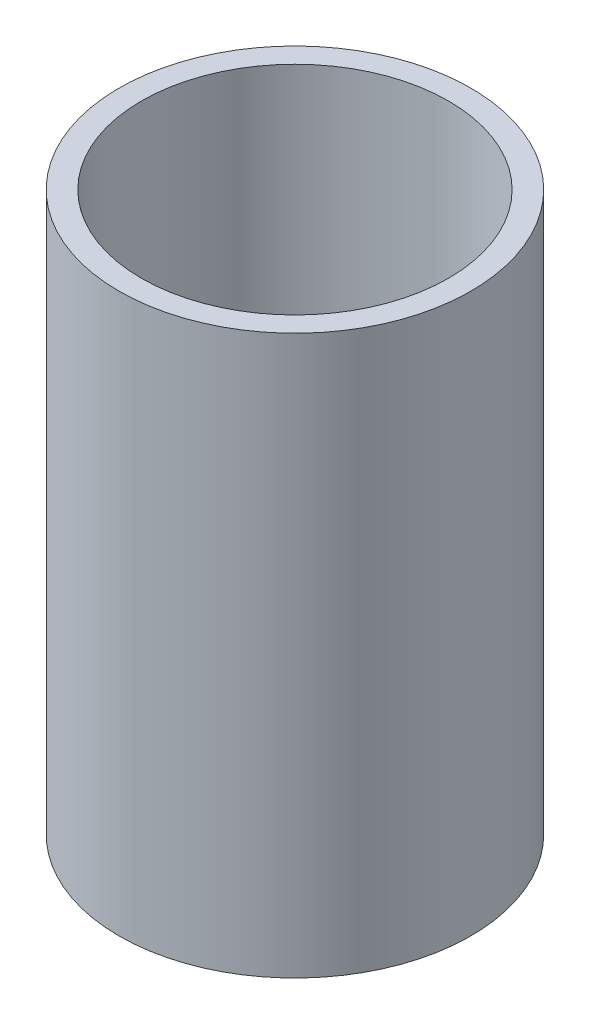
from build123d import *

# Parameters (mm, degrees)
SKIZZE1_R                       = 31.5
SKIZZE1_R_2                     = 27.5
AUFSATZ_LINEAR_AUSTRAGEN1_DEPTH = 100


with BuildPart() as part:
    # Skizze1 → Aufsatz-Linear austragen1 (new body)
    with BuildSketch(Plane(origin=(0, 0, 0), x_dir=(1, 0, 0), z_dir=(0, 1, 0))):
        with Locations(Location((0, 0, 0), (0, 0, 270))):
            Circle(SKIZZE1_R)
        with Locations(Location((0, 0, 0), (0, 0, 270))):
            Circle(SKIZZE1_R_2, mode=Mode.SUBTRACT)
    extrude(amount=AUFSATZ_LINEAR_AUSTRAGEN1_DEPTH)


solid = part.part
